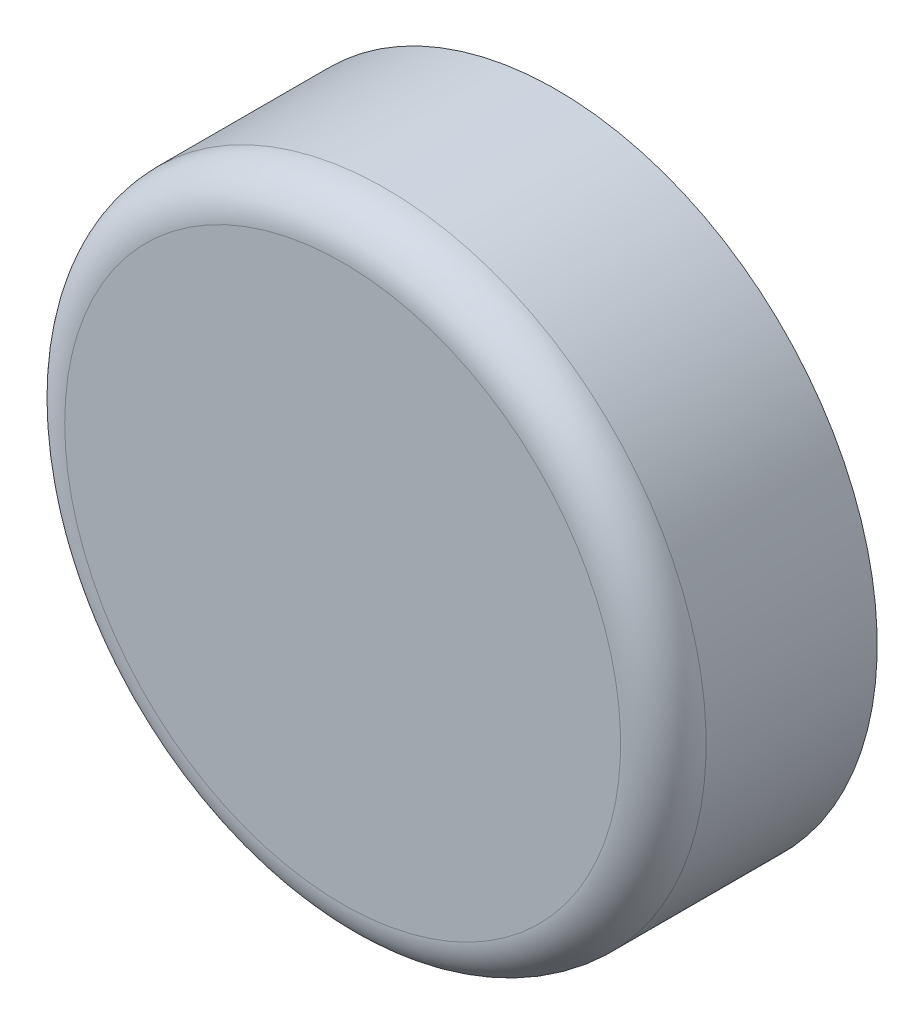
ISO-10303-21;
HEADER;
FILE_DESCRIPTION(('STEP AP214'),'2;1');
FILE_NAME('part.step','',(''),(''),'','','');
FILE_SCHEMA(('AUTOMOTIVE_DESIGN { 1 0 10303 214 1 1 1 1 }'));
ENDSEC;
DATA;
#1=APPLICATION_CONTEXT('core data for automotive mechanical design processes');
#2=APPLICATION_PROTOCOL_DEFINITION('international standard','automotive_design',2000,#1);
#3=PRODUCT_CONTEXT('',#1,'mechanical');
#4=PRODUCT('Part','Part','',(#3));
#5=PRODUCT_RELATED_PRODUCT_CATEGORY('part','',(#4));
#6=PRODUCT_DEFINITION_FORMATION('','',#4);
#7=PRODUCT_DEFINITION_CONTEXT('part definition',#1,'design');
#8=PRODUCT_DEFINITION('design','',#6,#7);
#9=PRODUCT_DEFINITION_SHAPE('','',#8);
#10=(LENGTH_UNIT() NAMED_UNIT(*) SI_UNIT(.MILLI.,.METRE.));
#11=(NAMED_UNIT(*) PLANE_ANGLE_UNIT() SI_UNIT($,.RADIAN.));
#12=(NAMED_UNIT(*) SI_UNIT($,.STERADIAN.) SOLID_ANGLE_UNIT());
#13=UNCERTAINTY_MEASURE_WITH_UNIT(LENGTH_MEASURE(1.E-05),#10,'distance_accuracy_value','');
#14=(GEOMETRIC_REPRESENTATION_CONTEXT(3) GLOBAL_UNCERTAINTY_ASSIGNED_CONTEXT((#13)) GLOBAL_UNIT_ASSIGNED_CONTEXT((#10,
#11,#12)) REPRESENTATION_CONTEXT('',''));
#15=CARTESIAN_POINT('',(0.,0.,0.));
#16=DIRECTION('',(0.,0.,1.));
#17=DIRECTION('',(1.,0.,0.));
#18=AXIS2_PLACEMENT_3D('',#15,#16,#17);
#19=CARTESIAN_POINT('',(0.,0.,28.0003873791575));
#20=DIRECTION('',(0.,0.,-1.));
#21=DIRECTION('',(-1.,0.,0.));
#22=AXIS2_PLACEMENT_3D('',#19,#20,#21);
#23=PLANE('',#22);
#24=CARTESIAN_POINT('',(0.,0.,28.0003873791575));
#25=DIRECTION('',(0.,0.,-1.));
#26=DIRECTION('',(-1.,0.,0.));
#27=AXIS2_PLACEMENT_3D('',#24,#25,#26);
#28=CIRCLE('',#27,6.5);
#29=CARTESIAN_POINT('',(-6.5,0.,28.0003873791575));
#30=VERTEX_POINT('',#29);
#31=EDGE_CURVE('E50',#30,#30,#28,.T.);
#32=ORIENTED_EDGE('',*,*,#31,.F.);
#33=EDGE_LOOP('',(#32));
#34=FACE_BOUND('',#33,.T.);
#35=ADVANCED_FACE('F12',(#34),#23,.F.);
#36=CARTESIAN_POINT('',(0.,0.,27.0003873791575));
#37=DIRECTION('',(0.,0.,-1.));
#38=DIRECTION('',(-1.,0.,0.));
#39=AXIS2_PLACEMENT_3D('',#36,#37,#38);
#40=TOROIDAL_SURFACE('',#39,6.5,1.);
#41=ORIENTED_EDGE('',*,*,#31,.T.);
#42=EDGE_LOOP('',(#41));
#43=FACE_BOUND('',#42,.T.);
#44=CARTESIAN_POINT('',(0.,0.,27.0003873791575));
#45=DIRECTION('',(0.,0.,-1.));
#46=DIRECTION('',(-1.,0.,0.));
#47=AXIS2_PLACEMENT_3D('',#44,#45,#46);
#48=CIRCLE('',#47,7.5);
#49=CARTESIAN_POINT('',(-7.5,0.,27.0003873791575));
#50=VERTEX_POINT('',#49);
#51=EDGE_CURVE('E47',#50,#50,#48,.T.);
#52=ORIENTED_EDGE('',*,*,#51,.F.);
#53=EDGE_LOOP('',(#52));
#54=FACE_BOUND('',#53,.T.);
#55=ADVANCED_FACE('F31',(#43,#54),#40,.T.);
#56=CARTESIAN_POINT('',(0.,0.,28.0003873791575));
#57=DIRECTION('',(0.,0.,-1.));
#58=DIRECTION('',(-1.,0.,0.));
#59=AXIS2_PLACEMENT_3D('',#56,#57,#58);
#60=CYLINDRICAL_SURFACE('',#59,7.5);
#61=ORIENTED_EDGE('',*,*,#51,.T.);
#62=EDGE_LOOP('',(#61));
#63=FACE_BOUND('',#62,.T.);
#64=CARTESIAN_POINT('',(0.,0.,23.0003873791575));
#65=DIRECTION('',(0.,0.,-1.));
#66=DIRECTION('',(-1.,0.,0.));
#67=AXIS2_PLACEMENT_3D('',#64,#65,#66);
#68=CIRCLE('',#67,7.5);
#69=CARTESIAN_POINT('',(-7.5,0.,23.0003873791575));
#70=VERTEX_POINT('',#69);
#71=EDGE_CURVE('E16',#70,#70,#68,.T.);
#72=ORIENTED_EDGE('',*,*,#71,.F.);
#73=EDGE_LOOP('',(#72));
#74=FACE_BOUND('',#73,.T.);
#75=ADVANCED_FACE('F41',(#63,#74),#60,.T.);
#76=CARTESIAN_POINT('',(0.,0.,23.0003873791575));
#77=DIRECTION('',(0.,0.,-1.));
#78=DIRECTION('',(-1.,0.,0.));
#79=AXIS2_PLACEMENT_3D('',#76,#77,#78);
#80=PLANE('',#79);
#81=CARTESIAN_POINT('',(0.,0.,23.0003873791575));
#82=DIRECTION('',(0.,0.,-1.));
#83=DIRECTION('',(-1.,0.,0.));
#84=AXIS2_PLACEMENT_3D('',#81,#82,#83);
#85=CIRCLE('',#84,6.8);
#86=CARTESIAN_POINT('',(-6.8,0.,23.0003873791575));
#87=VERTEX_POINT('',#86);
#88=EDGE_CURVE('E20',#87,#87,#85,.F.);
#89=ORIENTED_EDGE('',*,*,#88,.T.);
#90=EDGE_LOOP('',(#89));
#91=FACE_BOUND('',#90,.T.);
#92=ORIENTED_EDGE('',*,*,#71,.T.);
#93=EDGE_LOOP('',(#92));
#94=FACE_BOUND('',#93,.T.);
#95=ADVANCED_FACE('F64',(#91,#94),#80,.T.);
#96=CARTESIAN_POINT('',(0.,0.,26.4503873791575));
#97=DIRECTION('',(0.,0.,-1.));
#98=DIRECTION('',(-1.,0.,0.));
#99=AXIS2_PLACEMENT_3D('',#96,#97,#98);
#100=CYLINDRICAL_SURFACE('',#99,6.8);
#101=ORIENTED_EDGE('',*,*,#88,.F.);
#102=EDGE_LOOP('',(#101));
#103=FACE_BOUND('',#102,.T.);
#104=CARTESIAN_POINT('',(0.,0.,26.4503873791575));
#105=DIRECTION('',(0.,0.,-1.));
#106=DIRECTION('',(-1.,0.,0.));
#107=AXIS2_PLACEMENT_3D('',#104,#105,#106);
#108=CIRCLE('',#107,6.8);
#109=CARTESIAN_POINT('',(-6.8,0.,26.4503873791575));
#110=VERTEX_POINT('',#109);
#111=EDGE_CURVE('E8',#110,#110,#108,.T.);
#112=ORIENTED_EDGE('',*,*,#111,.F.);
#113=EDGE_LOOP('',(#112));
#114=FACE_BOUND('',#113,.T.);
#115=ADVANCED_FACE('F71',(#103,#114),#100,.F.);
#116=CARTESIAN_POINT('',(0.,0.,26.4503873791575));
#117=DIRECTION('',(0.,0.,-1.));
#118=DIRECTION('',(-1.,0.,0.));
#119=AXIS2_PLACEMENT_3D('',#116,#117,#118);
#120=PLANE('',#119);
#121=ORIENTED_EDGE('',*,*,#111,.T.);
#122=EDGE_LOOP('',(#121));
#123=FACE_BOUND('',#122,.T.);
#124=ADVANCED_FACE('F73',(#123),#120,.T.);
#125=CLOSED_SHELL('',(#35,#55,#75,#95,#115,#124));
#126=MANIFOLD_SOLID_BREP('B1',#125);
#127=ADVANCED_BREP_SHAPE_REPRESENTATION('',(#18,#126),#14);
#128=SHAPE_DEFINITION_REPRESENTATION(#9,#127);
ENDSEC;
END-ISO-10303-21;
